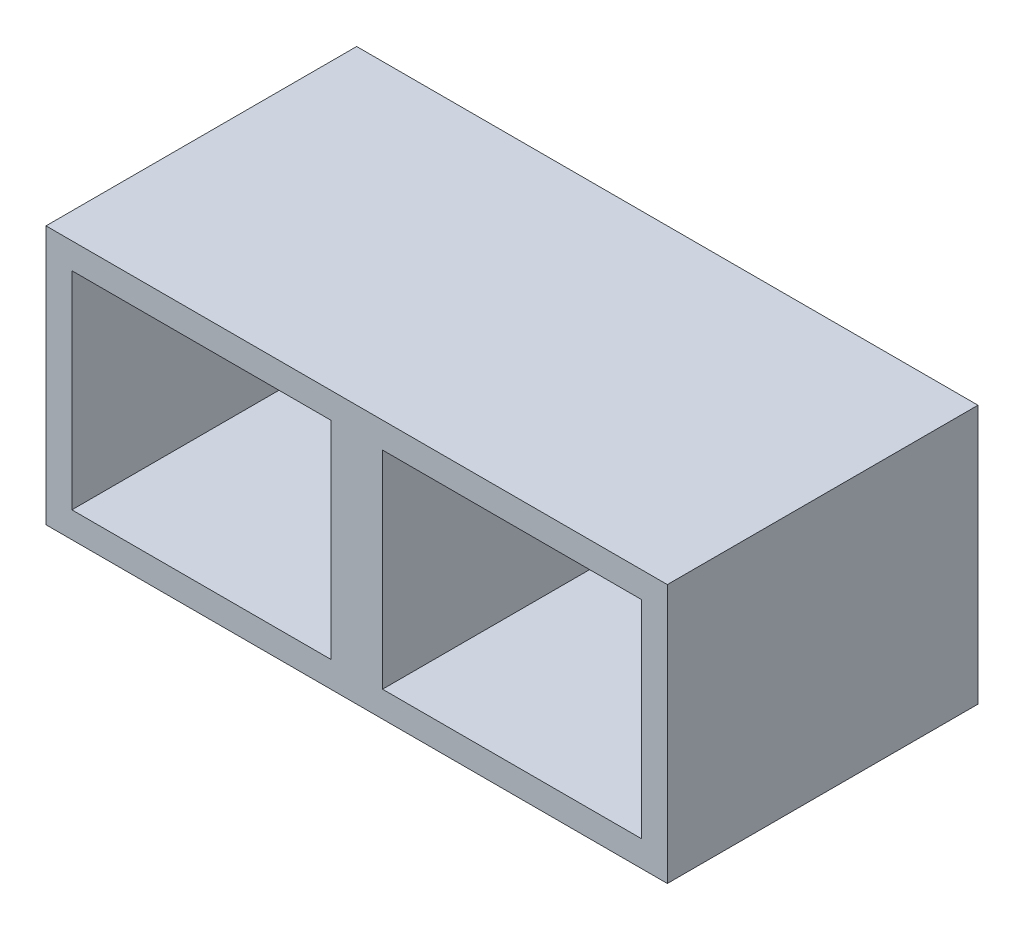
ISO-10303-21;
HEADER;
FILE_DESCRIPTION(('STEP AP214'),'2;1');
FILE_NAME('part.step','',(''),(''),'','','');
FILE_SCHEMA(('AUTOMOTIVE_DESIGN { 1 0 10303 214 1 1 1 1 }'));
ENDSEC;
DATA;
#1=APPLICATION_CONTEXT('core data for automotive mechanical design processes');
#2=APPLICATION_PROTOCOL_DEFINITION('international standard','automotive_design',2000,#1);
#3=PRODUCT_CONTEXT('',#1,'mechanical');
#4=PRODUCT('Part','Part','',(#3));
#5=PRODUCT_RELATED_PRODUCT_CATEGORY('part','',(#4));
#6=PRODUCT_DEFINITION_FORMATION('','',#4);
#7=PRODUCT_DEFINITION_CONTEXT('part definition',#1,'design');
#8=PRODUCT_DEFINITION('design','',#6,#7);
#9=PRODUCT_DEFINITION_SHAPE('','',#8);
#10=(LENGTH_UNIT() NAMED_UNIT(*) SI_UNIT(.MILLI.,.METRE.));
#11=(NAMED_UNIT(*) PLANE_ANGLE_UNIT() SI_UNIT($,.RADIAN.));
#12=(NAMED_UNIT(*) SI_UNIT($,.STERADIAN.) SOLID_ANGLE_UNIT());
#13=UNCERTAINTY_MEASURE_WITH_UNIT(LENGTH_MEASURE(1.E-05),#10,'distance_accuracy_value','');
#14=(GEOMETRIC_REPRESENTATION_CONTEXT(3) GLOBAL_UNCERTAINTY_ASSIGNED_CONTEXT((#13)) GLOBAL_UNIT_ASSIGNED_CONTEXT((#10,
#11,#12)) REPRESENTATION_CONTEXT('',''));
#15=CARTESIAN_POINT('',(0.,0.,0.));
#16=DIRECTION('',(0.,0.,1.));
#17=DIRECTION('',(1.,0.,0.));
#18=AXIS2_PLACEMENT_3D('',#15,#16,#17);
#19=CARTESIAN_POINT('',(-15.9501527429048,0.,6.));
#20=DIRECTION('',(-1.,0.,0.));
#21=DIRECTION('',(0.,0.,1.));
#22=AXIS2_PLACEMENT_3D('',#19,#20,#21);
#23=PLANE('',#22);
#24=DIRECTION('',(0.,1.,0.));
#25=VECTOR('',#24,1.);
#26=CARTESIAN_POINT('',(-15.9501527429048,0.,0.));
#27=LINE('',#26,#25);
#28=CARTESIAN_POINT('',(-15.9501527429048,33.6200326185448,0.));
#29=VERTEX_POINT('',#28);
#30=CARTESIAN_POINT('',(-15.9501527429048,37.6200326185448,0.));
#31=VERTEX_POINT('',#30);
#32=EDGE_CURVE('E161',#29,#31,#27,.T.);
#33=ORIENTED_EDGE('',*,*,#32,.F.);
#34=DIRECTION('',(0.,0.,-1.));
#35=VECTOR('',#34,1.);
#36=CARTESIAN_POINT('',(-15.9501527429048,33.6200326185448,6.));
#37=LINE('',#36,#35);
#38=CARTESIAN_POINT('',(-15.9501527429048,33.6200326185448,6.));
#39=VERTEX_POINT('',#38);
#40=EDGE_CURVE('E11',#39,#29,#37,.T.);
#41=ORIENTED_EDGE('',*,*,#40,.F.);
#42=DIRECTION('',(0.,1.,0.));
#43=VECTOR('',#42,1.);
#44=CARTESIAN_POINT('',(-15.9501527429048,0.,6.));
#45=LINE('',#44,#43);
#46=CARTESIAN_POINT('',(-15.9501527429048,37.6200326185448,6.));
#47=VERTEX_POINT('',#46);
#48=EDGE_CURVE('E121',#39,#47,#45,.T.);
#49=ORIENTED_EDGE('',*,*,#48,.T.);
#50=DIRECTION('',(0.,0.,-1.));
#51=VECTOR('',#50,1.);
#52=CARTESIAN_POINT('',(-15.9501527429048,37.6200326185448,6.));
#53=LINE('',#52,#51);
#54=EDGE_CURVE('E36',#47,#31,#53,.T.);
#55=ORIENTED_EDGE('',*,*,#54,.T.);
#56=EDGE_LOOP('',(#33,#41,#49,#55));
#57=FACE_BOUND('',#56,.T.);
#58=ADVANCED_FACE('F17',(#57),#23,.T.);
#59=CARTESIAN_POINT('',(0.,33.6200326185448,6.));
#60=DIRECTION('',(0.,-1.,0.));
#61=DIRECTION('',(0.,0.,-1.));
#62=AXIS2_PLACEMENT_3D('',#59,#60,#61);
#63=PLANE('',#62);
#64=DIRECTION('',(-1.,0.,0.));
#65=VECTOR('',#64,1.);
#66=CARTESIAN_POINT('',(0.,33.6200326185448,0.));
#67=LINE('',#66,#65);
#68=CARTESIAN_POINT('',(-20.9501527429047,33.6200326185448,0.));
#69=VERTEX_POINT('',#68);
#70=EDGE_CURVE('E127',#29,#69,#67,.T.);
#71=ORIENTED_EDGE('',*,*,#70,.T.);
#72=DIRECTION('',(0.,0.,-1.));
#73=VECTOR('',#72,1.);
#74=CARTESIAN_POINT('',(-20.9501527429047,33.6200326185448,6.));
#75=LINE('',#74,#73);
#76=CARTESIAN_POINT('',(-20.9501527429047,33.6200326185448,6.));
#77=VERTEX_POINT('',#76);
#78=EDGE_CURVE('E27',#77,#69,#75,.T.);
#79=ORIENTED_EDGE('',*,*,#78,.F.);
#80=DIRECTION('',(-1.,0.,0.));
#81=VECTOR('',#80,1.);
#82=CARTESIAN_POINT('',(0.,33.6200326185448,6.));
#83=LINE('',#82,#81);
#84=EDGE_CURVE('E115',#39,#77,#83,.T.);
#85=ORIENTED_EDGE('',*,*,#84,.F.);
#86=ORIENTED_EDGE('',*,*,#40,.T.);
#87=EDGE_LOOP('',(#71,#79,#85,#86));
#88=FACE_BOUND('',#87,.T.);
#89=ADVANCED_FACE('F125',(#88),#63,.F.);
#90=CARTESIAN_POINT('',(-20.9501527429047,0.,6.));
#91=DIRECTION('',(1.,0.,0.));
#92=DIRECTION('',(0.,0.,-1.));
#93=AXIS2_PLACEMENT_3D('',#90,#91,#92);
#94=PLANE('',#93);
#95=DIRECTION('',(0.,-1.,0.));
#96=VECTOR('',#95,1.);
#97=CARTESIAN_POINT('',(-20.9501527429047,0.,0.));
#98=LINE('',#97,#96);
#99=CARTESIAN_POINT('',(-20.9501527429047,37.6200326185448,0.));
#100=VERTEX_POINT('',#99);
#101=EDGE_CURVE('E164',#100,#69,#98,.T.);
#102=ORIENTED_EDGE('',*,*,#101,.F.);
#103=DIRECTION('',(0.,0.,-1.));
#104=VECTOR('',#103,1.);
#105=CARTESIAN_POINT('',(-20.9501527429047,37.6200326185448,6.));
#106=LINE('',#105,#104);
#107=CARTESIAN_POINT('',(-20.9501527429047,37.6200326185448,6.));
#108=VERTEX_POINT('',#107);
#109=EDGE_CURVE('E73',#108,#100,#106,.T.);
#110=ORIENTED_EDGE('',*,*,#109,.F.);
#111=DIRECTION('',(0.,-1.,0.));
#112=VECTOR('',#111,1.);
#113=CARTESIAN_POINT('',(-20.9501527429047,0.,6.));
#114=LINE('',#113,#112);
#115=EDGE_CURVE('E120',#108,#77,#114,.T.);
#116=ORIENTED_EDGE('',*,*,#115,.T.);
#117=ORIENTED_EDGE('',*,*,#78,.T.);
#118=EDGE_LOOP('',(#102,#110,#116,#117));
#119=FACE_BOUND('',#118,.T.);
#120=ADVANCED_FACE('F131',(#119),#94,.T.);
#121=CARTESIAN_POINT('',(0.,33.6200326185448,6.));
#122=DIRECTION('',(0.,-1.,0.));
#123=DIRECTION('',(0.,0.,-1.));
#124=AXIS2_PLACEMENT_3D('',#121,#122,#123);
#125=PLANE('',#124);
#126=DIRECTION('',(-1.,0.,0.));
#127=VECTOR('',#126,1.);
#128=CARTESIAN_POINT('',(0.,33.6200326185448,0.));
#129=LINE('',#128,#127);
#130=CARTESIAN_POINT('',(-9.95015274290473,33.6200326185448,0.));
#131=VERTEX_POINT('',#130);
#132=CARTESIAN_POINT('',(-14.9501527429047,33.6200326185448,0.));
#133=VERTEX_POINT('',#132);
#134=EDGE_CURVE('E149',#131,#133,#129,.T.);
#135=ORIENTED_EDGE('',*,*,#134,.T.);
#136=DIRECTION('',(0.,0.,-1.));
#137=VECTOR('',#136,1.);
#138=CARTESIAN_POINT('',(-14.9501527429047,33.6200326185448,6.));
#139=LINE('',#138,#137);
#140=CARTESIAN_POINT('',(-14.9501527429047,33.6200326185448,6.));
#141=VERTEX_POINT('',#140);
#142=EDGE_CURVE('E171',#141,#133,#139,.T.);
#143=ORIENTED_EDGE('',*,*,#142,.F.);
#144=DIRECTION('',(-1.,0.,0.));
#145=VECTOR('',#144,1.);
#146=CARTESIAN_POINT('',(0.,33.6200326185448,6.));
#147=LINE('',#146,#145);
#148=CARTESIAN_POINT('',(-9.95015274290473,33.6200326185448,6.));
#149=VERTEX_POINT('',#148);
#150=EDGE_CURVE('E206',#149,#141,#147,.T.);
#151=ORIENTED_EDGE('',*,*,#150,.F.);
#152=DIRECTION('',(0.,0.,-1.));
#153=VECTOR('',#152,1.);
#154=CARTESIAN_POINT('',(-9.95015274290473,33.6200326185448,6.));
#155=LINE('',#154,#153);
#156=EDGE_CURVE('E173',#149,#131,#155,.T.);
#157=ORIENTED_EDGE('',*,*,#156,.T.);
#158=EDGE_LOOP('',(#135,#143,#151,#157));
#159=FACE_BOUND('',#158,.T.);
#160=ADVANCED_FACE('F254',(#159),#125,.F.);
#161=CARTESIAN_POINT('',(-14.9501527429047,0.,6.));
#162=DIRECTION('',(-1.,0.,0.));
#163=DIRECTION('',(0.,0.,1.));
#164=AXIS2_PLACEMENT_3D('',#161,#162,#163);
#165=PLANE('',#164);
#166=DIRECTION('',(0.,1.,0.));
#167=VECTOR('',#166,1.);
#168=CARTESIAN_POINT('',(-14.9501527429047,0.,0.));
#169=LINE('',#168,#167);
#170=CARTESIAN_POINT('',(-14.9501527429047,37.6200326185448,0.));
#171=VERTEX_POINT('',#170);
#172=EDGE_CURVE('E152',#133,#171,#169,.T.);
#173=ORIENTED_EDGE('',*,*,#172,.T.);
#174=DIRECTION('',(0.,0.,-1.));
#175=VECTOR('',#174,1.);
#176=CARTESIAN_POINT('',(-14.9501527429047,37.6200326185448,6.));
#177=LINE('',#176,#175);
#178=CARTESIAN_POINT('',(-14.9501527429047,37.6200326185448,6.));
#179=VERTEX_POINT('',#178);
#180=EDGE_CURVE('E177',#179,#171,#177,.T.);
#181=ORIENTED_EDGE('',*,*,#180,.F.);
#182=DIRECTION('',(0.,1.,0.));
#183=VECTOR('',#182,1.);
#184=CARTESIAN_POINT('',(-14.9501527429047,0.,6.));
#185=LINE('',#184,#183);
#186=EDGE_CURVE('E215',#141,#179,#185,.T.);
#187=ORIENTED_EDGE('',*,*,#186,.F.);
#188=ORIENTED_EDGE('',*,*,#142,.T.);
#189=EDGE_LOOP('',(#173,#181,#187,#188));
#190=FACE_BOUND('',#189,.T.);
#191=ADVANCED_FACE('F250',(#190),#165,.F.);
#192=CARTESIAN_POINT('',(0.,37.6200326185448,6.));
#193=DIRECTION('',(0.,-1.,0.));
#194=DIRECTION('',(0.,0.,-1.));
#195=AXIS2_PLACEMENT_3D('',#192,#193,#194);
#196=PLANE('',#195);
#197=DIRECTION('',(-1.,0.,0.));
#198=VECTOR('',#197,1.);
#199=CARTESIAN_POINT('',(0.,37.6200326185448,0.));
#200=LINE('',#199,#198);
#201=CARTESIAN_POINT('',(-9.95015274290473,37.6200326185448,0.));
#202=VERTEX_POINT('',#201);
#203=EDGE_CURVE('E155',#202,#171,#200,.T.);
#204=ORIENTED_EDGE('',*,*,#203,.F.);
#205=DIRECTION('',(0.,0.,-1.));
#206=VECTOR('',#205,1.);
#207=CARTESIAN_POINT('',(-9.95015274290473,37.6200326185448,6.));
#208=LINE('',#207,#206);
#209=CARTESIAN_POINT('',(-9.95015274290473,37.6200326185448,6.));
#210=VERTEX_POINT('',#209);
#211=EDGE_CURVE('E175',#210,#202,#208,.T.);
#212=ORIENTED_EDGE('',*,*,#211,.F.);
#213=DIRECTION('',(-1.,0.,0.));
#214=VECTOR('',#213,1.);
#215=CARTESIAN_POINT('',(0.,37.6200326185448,6.));
#216=LINE('',#215,#214);
#217=EDGE_CURVE('E217',#210,#179,#216,.T.);
#218=ORIENTED_EDGE('',*,*,#217,.T.);
#219=ORIENTED_EDGE('',*,*,#180,.T.);
#220=EDGE_LOOP('',(#204,#212,#218,#219));
#221=FACE_BOUND('',#220,.T.);
#222=ADVANCED_FACE('F247',(#221),#196,.T.);
#223=CARTESIAN_POINT('',(0.,38.1200326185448,6.));
#224=DIRECTION('',(0.,-1.,0.));
#225=DIRECTION('',(0.,0.,-1.));
#226=AXIS2_PLACEMENT_3D('',#223,#224,#225);
#227=PLANE('',#226);
#228=DIRECTION('',(-1.,0.,0.));
#229=VECTOR('',#228,1.);
#230=CARTESIAN_POINT('',(0.,38.1200326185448,0.));
#231=LINE('',#230,#229);
#232=CARTESIAN_POINT('',(-9.45015274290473,38.1200326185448,0.));
#233=VERTEX_POINT('',#232);
#234=CARTESIAN_POINT('',(-21.4501527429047,38.1200326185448,0.));
#235=VERTEX_POINT('',#234);
#236=EDGE_CURVE('E138',#233,#235,#231,.T.);
#237=ORIENTED_EDGE('',*,*,#236,.T.);
#238=DIRECTION('',(0.,0.,-1.));
#239=VECTOR('',#238,1.);
#240=CARTESIAN_POINT('',(-21.4501527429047,38.1200326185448,6.));
#241=LINE('',#240,#239);
#242=CARTESIAN_POINT('',(-21.4501527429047,38.1200326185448,6.));
#243=VERTEX_POINT('',#242);
#244=EDGE_CURVE('E21',#243,#235,#241,.T.);
#245=ORIENTED_EDGE('',*,*,#244,.F.);
#246=DIRECTION('',(-1.,0.,0.));
#247=VECTOR('',#246,1.);
#248=CARTESIAN_POINT('',(0.,38.1200326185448,6.));
#249=LINE('',#248,#247);
#250=CARTESIAN_POINT('',(-9.45015274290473,38.1200326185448,6.));
#251=VERTEX_POINT('',#250);
#252=EDGE_CURVE('E169',#251,#243,#249,.T.);
#253=ORIENTED_EDGE('',*,*,#252,.F.);
#254=DIRECTION('',(0.,0.,-1.));
#255=VECTOR('',#254,1.);
#256=CARTESIAN_POINT('',(-9.45015274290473,38.1200326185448,6.));
#257=LINE('',#256,#255);
#258=EDGE_CURVE('E134',#251,#233,#257,.T.);
#259=ORIENTED_EDGE('',*,*,#258,.T.);
#260=EDGE_LOOP('',(#237,#245,#253,#259));
#261=FACE_BOUND('',#260,.T.);
#262=ADVANCED_FACE('F19',(#261),#227,.F.);
#263=CARTESIAN_POINT('',(-21.4501527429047,0.,6.));
#264=DIRECTION('',(1.,0.,0.));
#265=DIRECTION('',(0.,0.,-1.));
#266=AXIS2_PLACEMENT_3D('',#263,#264,#265);
#267=PLANE('',#266);
#268=DIRECTION('',(0.,-1.,0.));
#269=VECTOR('',#268,1.);
#270=CARTESIAN_POINT('',(-21.4501527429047,0.,0.));
#271=LINE('',#270,#269);
#272=CARTESIAN_POINT('',(-21.4501527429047,33.1200326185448,0.));
#273=VERTEX_POINT('',#272);
#274=EDGE_CURVE('E141',#235,#273,#271,.T.);
#275=ORIENTED_EDGE('',*,*,#274,.T.);
#276=DIRECTION('',(0.,0.,-1.));
#277=VECTOR('',#276,1.);
#278=CARTESIAN_POINT('',(-21.4501527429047,33.1200326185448,6.));
#279=LINE('',#278,#277);
#280=CARTESIAN_POINT('',(-21.4501527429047,33.1200326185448,6.));
#281=VERTEX_POINT('',#280);
#282=EDGE_CURVE('E184',#281,#273,#279,.T.);
#283=ORIENTED_EDGE('',*,*,#282,.F.);
#284=DIRECTION('',(0.,-1.,0.));
#285=VECTOR('',#284,1.);
#286=CARTESIAN_POINT('',(-21.4501527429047,0.,6.));
#287=LINE('',#286,#285);
#288=EDGE_CURVE('E86',#243,#281,#287,.T.);
#289=ORIENTED_EDGE('',*,*,#288,.F.);
#290=ORIENTED_EDGE('',*,*,#244,.T.);
#291=EDGE_LOOP('',(#275,#283,#289,#290));
#292=FACE_BOUND('',#291,.T.);
#293=ADVANCED_FACE('F189',(#292),#267,.F.);
#294=CARTESIAN_POINT('',(0.,33.1200326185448,6.));
#295=DIRECTION('',(0.,-1.,0.));
#296=DIRECTION('',(0.,0.,-1.));
#297=AXIS2_PLACEMENT_3D('',#294,#295,#296);
#298=PLANE('',#297);
#299=DIRECTION('',(-1.,0.,0.));
#300=VECTOR('',#299,1.);
#301=CARTESIAN_POINT('',(0.,33.1200326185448,0.));
#302=LINE('',#301,#300);
#303=CARTESIAN_POINT('',(-9.45015274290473,33.1200326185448,0.));
#304=VERTEX_POINT('',#303);
#305=EDGE_CURVE('E144',#304,#273,#302,.T.);
#306=ORIENTED_EDGE('',*,*,#305,.F.);
#307=DIRECTION('',(0.,0.,-1.));
#308=VECTOR('',#307,1.);
#309=CARTESIAN_POINT('',(-9.45015274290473,33.1200326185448,6.));
#310=LINE('',#309,#308);
#311=CARTESIAN_POINT('',(-9.45015274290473,33.1200326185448,6.));
#312=VERTEX_POINT('',#311);
#313=EDGE_CURVE('E183',#312,#304,#310,.T.);
#314=ORIENTED_EDGE('',*,*,#313,.F.);
#315=DIRECTION('',(-1.,0.,0.));
#316=VECTOR('',#315,1.);
#317=CARTESIAN_POINT('',(0.,33.1200326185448,6.));
#318=LINE('',#317,#316);
#319=EDGE_CURVE('E201',#312,#281,#318,.T.);
#320=ORIENTED_EDGE('',*,*,#319,.T.);
#321=ORIENTED_EDGE('',*,*,#282,.T.);
#322=EDGE_LOOP('',(#306,#314,#320,#321));
#323=FACE_BOUND('',#322,.T.);
#324=ADVANCED_FACE('F198',(#323),#298,.T.);
#325=CARTESIAN_POINT('',(-9.95015274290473,0.,6.));
#326=DIRECTION('',(-1.,0.,0.));
#327=DIRECTION('',(0.,0.,1.));
#328=AXIS2_PLACEMENT_3D('',#325,#326,#327);
#329=PLANE('',#328);
#330=DIRECTION('',(0.,1.,0.));
#331=VECTOR('',#330,1.);
#332=CARTESIAN_POINT('',(-9.95015274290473,0.,0.));
#333=LINE('',#332,#331);
#334=EDGE_CURVE('E158',#131,#202,#333,.T.);
#335=ORIENTED_EDGE('',*,*,#334,.F.);
#336=ORIENTED_EDGE('',*,*,#156,.F.);
#337=DIRECTION('',(0.,1.,0.));
#338=VECTOR('',#337,1.);
#339=CARTESIAN_POINT('',(-9.95015274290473,0.,6.));
#340=LINE('',#339,#338);
#341=EDGE_CURVE('E220',#149,#210,#340,.T.);
#342=ORIENTED_EDGE('',*,*,#341,.T.);
#343=ORIENTED_EDGE('',*,*,#211,.T.);
#344=EDGE_LOOP('',(#335,#336,#342,#343));
#345=FACE_BOUND('',#344,.T.);
#346=ADVANCED_FACE('F232',(#345),#329,.T.);
#347=CARTESIAN_POINT('',(-9.45015274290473,0.,6.));
#348=DIRECTION('',(-1.,0.,0.));
#349=DIRECTION('',(0.,0.,1.));
#350=AXIS2_PLACEMENT_3D('',#347,#348,#349);
#351=PLANE('',#350);
#352=DIRECTION('',(0.,1.,0.));
#353=VECTOR('',#352,1.);
#354=CARTESIAN_POINT('',(-9.45015274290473,0.,0.));
#355=LINE('',#354,#353);
#356=EDGE_CURVE('E147',#304,#233,#355,.T.);
#357=ORIENTED_EDGE('',*,*,#356,.T.);
#358=ORIENTED_EDGE('',*,*,#258,.F.);
#359=DIRECTION('',(0.,1.,0.));
#360=VECTOR('',#359,1.);
#361=CARTESIAN_POINT('',(-9.45015274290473,0.,6.));
#362=LINE('',#361,#360);
#363=EDGE_CURVE('E203',#312,#251,#362,.T.);
#364=ORIENTED_EDGE('',*,*,#363,.F.);
#365=ORIENTED_EDGE('',*,*,#313,.T.);
#366=EDGE_LOOP('',(#357,#358,#364,#365));
#367=FACE_BOUND('',#366,.T.);
#368=ADVANCED_FACE('F204',(#367),#351,.F.);
#369=CARTESIAN_POINT('',(0.,37.6200326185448,6.));
#370=DIRECTION('',(0.,-1.,0.));
#371=DIRECTION('',(0.,0.,-1.));
#372=AXIS2_PLACEMENT_3D('',#369,#370,#371);
#373=PLANE('',#372);
#374=DIRECTION('',(-1.,0.,0.));
#375=VECTOR('',#374,1.);
#376=CARTESIAN_POINT('',(0.,37.6200326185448,0.));
#377=LINE('',#376,#375);
#378=EDGE_CURVE('E166',#31,#100,#377,.T.);
#379=ORIENTED_EDGE('',*,*,#378,.F.);
#380=ORIENTED_EDGE('',*,*,#54,.F.);
#381=DIRECTION('',(-1.,0.,0.));
#382=VECTOR('',#381,1.);
#383=CARTESIAN_POINT('',(0.,37.6200326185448,6.));
#384=LINE('',#383,#382);
#385=EDGE_CURVE('E132',#47,#108,#384,.T.);
#386=ORIENTED_EDGE('',*,*,#385,.T.);
#387=ORIENTED_EDGE('',*,*,#109,.T.);
#388=EDGE_LOOP('',(#379,#380,#386,#387));
#389=FACE_BOUND('',#388,.T.);
#390=ADVANCED_FACE('F222',(#389),#373,.T.);
#391=CARTESIAN_POINT('',(0.,0.,6.));
#392=DIRECTION('',(0.,0.,1.));
#393=DIRECTION('',(1.,0.,0.));
#394=AXIS2_PLACEMENT_3D('',#391,#392,#393);
#395=PLANE('',#394);
#396=ORIENTED_EDGE('',*,*,#252,.T.);
#397=ORIENTED_EDGE('',*,*,#288,.T.);
#398=ORIENTED_EDGE('',*,*,#319,.F.);
#399=ORIENTED_EDGE('',*,*,#363,.T.);
#400=EDGE_LOOP('',(#396,#397,#398,#399));
#401=FACE_BOUND('',#400,.T.);
#402=ORIENTED_EDGE('',*,*,#150,.T.);
#403=ORIENTED_EDGE('',*,*,#186,.T.);
#404=ORIENTED_EDGE('',*,*,#217,.F.);
#405=ORIENTED_EDGE('',*,*,#341,.F.);
#406=EDGE_LOOP('',(#402,#403,#404,#405));
#407=FACE_BOUND('',#406,.T.);
#408=ORIENTED_EDGE('',*,*,#48,.F.);
#409=ORIENTED_EDGE('',*,*,#84,.T.);
#410=ORIENTED_EDGE('',*,*,#115,.F.);
#411=ORIENTED_EDGE('',*,*,#385,.F.);
#412=EDGE_LOOP('',(#408,#409,#410,#411));
#413=FACE_BOUND('',#412,.T.);
#414=ADVANCED_FACE('F117',(#401,#407,#413),#395,.T.);
#415=CARTESIAN_POINT('',(0.,0.,0.));
#416=DIRECTION('',(0.,0.,1.));
#417=DIRECTION('',(1.,0.,0.));
#418=AXIS2_PLACEMENT_3D('',#415,#416,#417);
#419=PLANE('',#418);
#420=ORIENTED_EDGE('',*,*,#236,.F.);
#421=ORIENTED_EDGE('',*,*,#356,.F.);
#422=ORIENTED_EDGE('',*,*,#305,.T.);
#423=ORIENTED_EDGE('',*,*,#274,.F.);
#424=EDGE_LOOP('',(#420,#421,#422,#423));
#425=FACE_BOUND('',#424,.T.);
#426=ORIENTED_EDGE('',*,*,#134,.F.);
#427=ORIENTED_EDGE('',*,*,#334,.T.);
#428=ORIENTED_EDGE('',*,*,#203,.T.);
#429=ORIENTED_EDGE('',*,*,#172,.F.);
#430=EDGE_LOOP('',(#426,#427,#428,#429));
#431=FACE_BOUND('',#430,.T.);
#432=ORIENTED_EDGE('',*,*,#32,.T.);
#433=ORIENTED_EDGE('',*,*,#378,.T.);
#434=ORIENTED_EDGE('',*,*,#101,.T.);
#435=ORIENTED_EDGE('',*,*,#70,.F.);
#436=EDGE_LOOP('',(#432,#433,#434,#435));
#437=FACE_BOUND('',#436,.T.);
#438=ADVANCED_FACE('F196',(#425,#431,#437),#419,.F.);
#439=CLOSED_SHELL('',(#58,#89,#120,#160,#191,#222,#262,#293,#324,#346,#368,#390,#414,#438));
#440=MANIFOLD_SOLID_BREP('B1',#439);
#441=ADVANCED_BREP_SHAPE_REPRESENTATION('',(#18,#440),#14);
#442=SHAPE_DEFINITION_REPRESENTATION(#9,#441);
ENDSEC;
END-ISO-10303-21;
